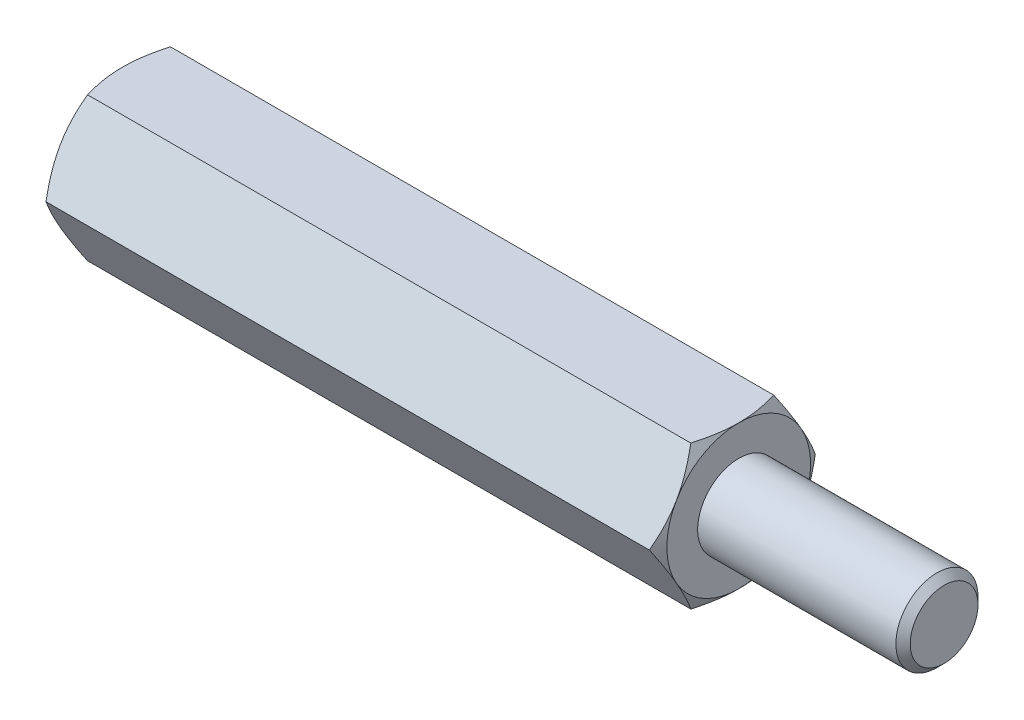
ISO-10303-21;
HEADER;
FILE_DESCRIPTION(('STEP AP214'),'2;1');
FILE_NAME('part.step','',(''),(''),'','','');
FILE_SCHEMA(('AUTOMOTIVE_DESIGN { 1 0 10303 214 1 1 1 1 }'));
ENDSEC;
DATA;
#1=APPLICATION_CONTEXT('core data for automotive mechanical design processes');
#2=APPLICATION_PROTOCOL_DEFINITION('international standard','automotive_design',2000,#1);
#3=PRODUCT_CONTEXT('',#1,'mechanical');
#4=PRODUCT('Part','Part','',(#3));
#5=PRODUCT_RELATED_PRODUCT_CATEGORY('part','',(#4));
#6=PRODUCT_DEFINITION_FORMATION('','',#4);
#7=PRODUCT_DEFINITION_CONTEXT('part definition',#1,'design');
#8=PRODUCT_DEFINITION('design','',#6,#7);
#9=PRODUCT_DEFINITION_SHAPE('','',#8);
#10=(LENGTH_UNIT() NAMED_UNIT(*) SI_UNIT(.MILLI.,.METRE.));
#11=(NAMED_UNIT(*) PLANE_ANGLE_UNIT() SI_UNIT($,.RADIAN.));
#12=(NAMED_UNIT(*) SI_UNIT($,.STERADIAN.) SOLID_ANGLE_UNIT());
#13=UNCERTAINTY_MEASURE_WITH_UNIT(LENGTH_MEASURE(1.E-05),#10,'distance_accuracy_value','');
#14=(GEOMETRIC_REPRESENTATION_CONTEXT(3) GLOBAL_UNCERTAINTY_ASSIGNED_CONTEXT((#13)) GLOBAL_UNIT_ASSIGNED_CONTEXT((#10,
#11,#12)) REPRESENTATION_CONTEXT('',''));
#15=CARTESIAN_POINT('',(0.,0.,0.));
#16=DIRECTION('',(0.,0.,1.));
#17=DIRECTION('',(1.,0.,0.));
#18=AXIS2_PLACEMENT_3D('',#15,#16,#17);
#19=CARTESIAN_POINT('',(15.,3.5,-2.02072594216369));
#20=DIRECTION('',(1.,0.,0.));
#21=DIRECTION('',(0.,0.,-1.));
#22=AXIS2_PLACEMENT_3D('',#19,#20,#21);
#23=PLANE('',#22);
#24=CARTESIAN_POINT('',(15.,0.,0.));
#25=DIRECTION('',(1.,0.,0.));
#26=DIRECTION('',(0.,0.,-1.));
#27=AXIS2_PLACEMENT_3D('',#24,#25,#26);
#28=CIRCLE('',#27,3.5);
#29=CARTESIAN_POINT('',(15.,-1.75,-3.03108891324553));
#30=VERTEX_POINT('',#29);
#31=CARTESIAN_POINT('',(15.,1.75,-3.03108891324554));
#32=VERTEX_POINT('',#31);
#33=EDGE_CURVE('E288',#30,#32,#28,.T.);
#34=ORIENTED_EDGE('',*,*,#33,.T.);
#35=CARTESIAN_POINT('',(15.,3.5,0.));
#36=VERTEX_POINT('',#35);
#37=EDGE_CURVE('E53',#32,#36,#28,.T.);
#38=ORIENTED_EDGE('',*,*,#37,.T.);
#39=CARTESIAN_POINT('',(15.,1.75,3.03108891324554));
#40=VERTEX_POINT('',#39);
#41=EDGE_CURVE('E297',#36,#40,#28,.T.);
#42=ORIENTED_EDGE('',*,*,#41,.T.);
#43=CARTESIAN_POINT('',(15.,-1.75000000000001,3.03108891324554));
#44=VERTEX_POINT('',#43);
#45=EDGE_CURVE('E301',#40,#44,#28,.T.);
#46=ORIENTED_EDGE('',*,*,#45,.T.);
#47=CARTESIAN_POINT('',(15.,0.,0.));
#48=DIRECTION('',(-1.,0.,0.));
#49=DIRECTION('',(0.,-1.,0.));
#50=AXIS2_PLACEMENT_3D('',#47,#48,#49);
#51=CIRCLE('',#50,3.5);
#52=CARTESIAN_POINT('',(15.,-3.50000000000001,0.));
#53=VERTEX_POINT('',#52);
#54=EDGE_CURVE('E193',#53,#44,#51,.T.);
#55=ORIENTED_EDGE('',*,*,#54,.F.);
#56=EDGE_CURVE('E61',#53,#30,#28,.T.);
#57=ORIENTED_EDGE('',*,*,#56,.T.);
#58=EDGE_LOOP('',(#34,#38,#42,#46,#55,#57));
#59=FACE_BOUND('',#58,.T.);
#60=CARTESIAN_POINT('',(15.,0.,0.));
#61=DIRECTION('',(1.,0.,0.));
#62=DIRECTION('',(0.,0.,-1.));
#63=AXIS2_PLACEMENT_3D('',#60,#61,#62);
#64=CIRCLE('',#63,2.);
#65=CARTESIAN_POINT('',(15.,0.,-2.));
#66=VERTEX_POINT('',#65);
#67=EDGE_CURVE('E324',#66,#66,#64,.T.);
#68=ORIENTED_EDGE('',*,*,#67,.F.);
#69=EDGE_LOOP('',(#68));
#70=FACE_BOUND('',#69,.T.);
#71=ADVANCED_FACE('F37',(#59,#70),#23,.T.);
#72=CARTESIAN_POINT('',(15.,0.,-4.04145188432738));
#73=DIRECTION('',(0.,-0.5,0.866025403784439));
#74=DIRECTION('',(0.,-0.866025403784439,-0.5));
#75=AXIS2_PLACEMENT_3D('',#72,#73,#74);
#76=PLANE('',#75);
#77=CARTESIAN_POINT('',(14.6873259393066,-0.000200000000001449,-4.04156735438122));
#78=CARTESIAN_POINT('',(14.73861421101,0.153607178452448,-3.9527667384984));
#79=CARTESIAN_POINT('',(14.7852590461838,0.308742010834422,-3.86319960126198));
#80=CARTESIAN_POINT('',(14.8666781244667,0.621698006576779,-3.68251437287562));
#81=CARTESIAN_POINT('',(14.9014235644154,0.779524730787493,-3.59139307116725));
#82=CARTESIAN_POINT('',(14.9555099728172,1.09322221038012,-3.41027974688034));
#83=CARTESIAN_POINT('',(14.9752109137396,1.24904469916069,-3.32031559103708));
#84=CARTESIAN_POINT('',(14.9987298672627,1.56142288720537,-3.13996396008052));
#85=CARTESIAN_POINT('',(15.0025673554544,1.71797745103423,-3.04957714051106));
#86=CARTESIAN_POINT('',(14.994584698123,2.01050921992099,-2.88068384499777));
#87=CARTESIAN_POINT('',(14.9847245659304,2.1465302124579,-2.80215208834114));
#88=CARTESIAN_POINT('',(14.9534735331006,2.41768602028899,-2.64560020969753));
#89=CARTESIAN_POINT('',(14.9320719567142,2.55281989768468,-2.5675806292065));
#90=CARTESIAN_POINT('',(14.8785695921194,2.82453479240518,-2.41070596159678));
#91=CARTESIAN_POINT('',(14.8462420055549,2.96108141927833,-2.33187072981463));
#92=CARTESIAN_POINT('',(14.772871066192,3.2321380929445,-2.17537608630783));
#93=CARTESIAN_POINT('',(14.7318449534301,3.36665161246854,-2.09771466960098));
#94=CARTESIAN_POINT('',(14.6873259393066,3.5002,-2.02061047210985));
#95=B_SPLINE_CURVE_WITH_KNOTS('',3,(#77,#78,#79,#80,#81,#82,#83,#84,#85,#86,#87,#88,#89,#90,#91,
#92,#93,#94),.UNSPECIFIED.,.F.,.F.,(4,2,2,2,2,2,2,2,4),(0.,0.554793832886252,1.11092123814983,
1.65328467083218,2.19498204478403,2.6666513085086,3.13875761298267,3.6213361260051,
4.10296698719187),.UNSPECIFIED.);
#96=CARTESIAN_POINT('',(14.6873926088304,0.,-4.04145188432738));
#97=VERTEX_POINT('',#96);
#98=EDGE_CURVE('E333',#97,#32,#95,.T.);
#99=ORIENTED_EDGE('',*,*,#98,.F.);
#100=DIRECTION('',(-1.,0.,0.));
#101=VECTOR('',#100,1.);
#102=CARTESIAN_POINT('',(15.,0.,-4.04145188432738));
#103=LINE('',#102,#101);
#104=CARTESIAN_POINT('',(-14.6873926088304,0.,-4.04145188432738));
#105=VERTEX_POINT('',#104);
#106=EDGE_CURVE('E264',#97,#105,#103,.T.);
#107=ORIENTED_EDGE('',*,*,#106,.T.);
#108=CARTESIAN_POINT('',(-14.6873259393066,3.5002,-2.02061047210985));
#109=CARTESIAN_POINT('',(-14.73861421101,3.34639282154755,-2.10941108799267));
#110=CARTESIAN_POINT('',(-14.7852590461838,3.19125798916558,-2.19897822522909));
#111=CARTESIAN_POINT('',(-14.8666781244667,2.87830199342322,-2.37966345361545));
#112=CARTESIAN_POINT('',(-14.9014235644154,2.7204752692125,-2.47078475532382));
#113=CARTESIAN_POINT('',(-14.9555099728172,2.40677778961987,-2.65189807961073));
#114=CARTESIAN_POINT('',(-14.9752109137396,2.25095530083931,-2.74186223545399));
#115=CARTESIAN_POINT('',(-14.9987298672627,1.93857711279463,-2.92221386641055));
#116=CARTESIAN_POINT('',(-15.0025673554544,1.78202254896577,-3.01260068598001));
#117=CARTESIAN_POINT('',(-14.994584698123,1.48949078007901,-3.1814939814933));
#118=CARTESIAN_POINT('',(-14.9847245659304,1.35346978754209,-3.26002573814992));
#119=CARTESIAN_POINT('',(-14.9534735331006,1.08231397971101,-3.41657761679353));
#120=CARTESIAN_POINT('',(-14.9320719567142,0.947180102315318,-3.49459719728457));
#121=CARTESIAN_POINT('',(-14.8785695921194,0.675465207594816,-3.65147186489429));
#122=CARTESIAN_POINT('',(-14.8462420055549,0.538918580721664,-3.73030709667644));
#123=CARTESIAN_POINT('',(-14.772871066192,0.267861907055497,-3.88680174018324));
#124=CARTESIAN_POINT('',(-14.7318449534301,0.133348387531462,-3.96446315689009));
#125=CARTESIAN_POINT('',(-14.6873259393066,-0.000200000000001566,-4.04156735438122));
#126=B_SPLINE_CURVE_WITH_KNOTS('',3,(#108,#109,#110,#111,#112,#113,#114,#115,#116,#117,#118,
#119,#120,#121,#122,#123,#124,#125),.UNSPECIFIED.,.F.,.F.,(4,2,2,2,2,2,2,2,4),(0.,
0.554793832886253,1.11092123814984,1.65328467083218,2.19498204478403,2.6666513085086,
3.13875761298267,3.6213361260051,4.10296698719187),.UNSPECIFIED.);
#127=CARTESIAN_POINT('',(-15.,1.75,-3.03108891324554));
#128=VERTEX_POINT('',#127);
#129=EDGE_CURVE('E343',#128,#105,#126,.T.);
#130=ORIENTED_EDGE('',*,*,#129,.F.);
#131=CARTESIAN_POINT('',(-14.6873926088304,3.5,-2.02072594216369));
#132=VERTEX_POINT('',#131);
#133=EDGE_CURVE('E348',#132,#128,#126,.T.);
#134=ORIENTED_EDGE('',*,*,#133,.F.);
#135=DIRECTION('',(-1.,0.,0.));
#136=VECTOR('',#135,1.);
#137=CARTESIAN_POINT('',(15.,3.5,-2.02072594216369));
#138=LINE('',#137,#136);
#139=CARTESIAN_POINT('',(14.6873926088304,3.5,-2.02072594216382));
#140=VERTEX_POINT('',#139);
#141=EDGE_CURVE('E279',#140,#132,#138,.T.);
#142=ORIENTED_EDGE('',*,*,#141,.F.);
#143=EDGE_CURVE('E229',#32,#140,#95,.T.);
#144=ORIENTED_EDGE('',*,*,#143,.F.);
#145=EDGE_LOOP('',(#99,#107,#130,#134,#142,#144));
#146=FACE_BOUND('',#145,.T.);
#147=ADVANCED_FACE('F148',(#146),#76,.F.);
#148=CARTESIAN_POINT('',(15.,3.5,-2.02072594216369));
#149=DIRECTION('',(0.,-1.,0.));
#150=DIRECTION('',(0.,0.,-1.));
#151=AXIS2_PLACEMENT_3D('',#148,#149,#150);
#152=PLANE('',#151);
#153=CARTESIAN_POINT('',(13.2443294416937,3.5,-5.525713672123));
#154=CARTESIAN_POINT('',(13.3192813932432,3.5,-5.37200190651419));
#155=CARTESIAN_POINT('',(13.3935424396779,3.5,-5.21794762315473));
#156=CARTESIAN_POINT('',(13.5402960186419,3.5,-4.90897223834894));
#157=CARTESIAN_POINT('',(13.6127882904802,3.5,-4.75405101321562));
#158=CARTESIAN_POINT('',(13.7559617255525,3.5,-4.44240758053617));
#159=CARTESIAN_POINT('',(13.8266316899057,3.5,-4.28568021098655));
#160=CARTESIAN_POINT('',(13.9652074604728,3.5,-3.97101270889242));
#161=CARTESIAN_POINT('',(14.0331133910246,3.5,-3.81307263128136));
#162=CARTESIAN_POINT('',(14.1677143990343,3.5,-3.49026114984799));
#163=CARTESIAN_POINT('',(14.2342871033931,3.5,-3.32533845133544));
#164=CARTESIAN_POINT('',(14.3626267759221,3.5,-2.99359992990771));
#165=CARTESIAN_POINT('',(14.4243932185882,3.5,-2.82678390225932));
#166=CARTESIAN_POINT('',(14.5415700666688,3.5,-2.49127529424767));
#167=CARTESIAN_POINT('',(14.5969925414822,3.5,-2.32258697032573));
#168=CARTESIAN_POINT('',(14.6997679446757,3.5,-1.98279215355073));
#169=CARTESIAN_POINT('',(14.7471233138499,3.5,-1.81168640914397));
#170=CARTESIAN_POINT('',(14.8312987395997,3.5,-1.46793354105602));
#171=CARTESIAN_POINT('',(14.8681796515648,3.5,-1.2953015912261));
#172=CARTESIAN_POINT('',(14.9293955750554,3.5,-0.94779164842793));
#173=CARTESIAN_POINT('',(14.953731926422,3.5,-0.772913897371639));
#174=CARTESIAN_POINT('',(14.9876038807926,3.5,-0.424108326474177));
#175=CARTESIAN_POINT('',(14.997337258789,3.5,-0.25020019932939));
#176=CARTESIAN_POINT('',(15.0017053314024,3.5,0.0978233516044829));
#177=CARTESIAN_POINT('',(14.9963399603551,3.5,0.271938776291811));
#178=CARTESIAN_POINT('',(14.9750118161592,3.5,0.564711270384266));
#179=CARTESIAN_POINT('',(14.9628919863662,3.5,0.683667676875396));
#180=CARTESIAN_POINT('',(14.9323080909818,3.5,0.920767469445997));
#181=CARTESIAN_POINT('',(14.9138432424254,3.5,1.03891075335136));
#182=CARTESIAN_POINT('',(14.8498956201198,3.5,1.39193174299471));
#183=CARTESIAN_POINT('',(14.7958695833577,3.5,1.62528232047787));
#184=CARTESIAN_POINT('',(14.7014515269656,3.5,1.97433825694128));
#185=CARTESIAN_POINT('',(14.6672900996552,3.5,2.09183268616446));
#186=CARTESIAN_POINT('',(14.595234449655,3.5,2.32568238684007));
#187=CARTESIAN_POINT('',(14.5573401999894,3.5,2.44203765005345));
#188=CARTESIAN_POINT('',(14.4784421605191,3.5,2.67364238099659));
#189=CARTESIAN_POINT('',(14.4374392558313,3.5,2.78889215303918));
#190=CARTESIAN_POINT('',(14.352824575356,3.5,3.01842460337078));
#191=CARTESIAN_POINT('',(14.3092128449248,3.5,3.13270729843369));
#192=CARTESIAN_POINT('',(14.1958241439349,3.5,3.42150510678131));
#193=CARTESIAN_POINT('',(14.1245636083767,3.5,3.59543696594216));
#194=CARTESIAN_POINT('',(13.9781026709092,3.5,3.94163961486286));
#195=CARTESIAN_POINT('',(13.9029019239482,3.5,4.11391025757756));
#196=CARTESIAN_POINT('',(13.7494252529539,3.5,4.45713072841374));
#197=CARTESIAN_POINT('',(13.6711484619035,3.5,4.62808016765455));
#198=CARTESIAN_POINT('',(13.512188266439,3.5,4.9688584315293));
#199=CARTESIAN_POINT('',(13.4315047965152,3.5,5.13868722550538));
#200=CARTESIAN_POINT('',(13.1863871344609,3.5,5.64726192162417));
#201=CARTESIAN_POINT('',(13.0190975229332,3.5,5.98463020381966));
#202=CARTESIAN_POINT('',(12.6795854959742,3.5,6.65678495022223));
#203=CARTESIAN_POINT('',(12.5073639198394,3.5,6.99157184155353));
#204=CARTESIAN_POINT('',(12.1760800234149,3.5,7.62749570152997));
#205=CARTESIAN_POINT('',(12.0173299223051,3.5,7.92879562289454));
#206=CARTESIAN_POINT('',(11.6977473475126,3.5,8.53030635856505));
#207=CARTESIAN_POINT('',(11.5369147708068,3.5,8.83051711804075));
#208=CARTESIAN_POINT('',(11.2141792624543,3.5,9.42918006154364));
#209=CARTESIAN_POINT('',(11.0522810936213,3.5,9.72763481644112));
#210=CARTESIAN_POINT('',(10.7272737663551,3.5,10.3238577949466));
#211=CARTESIAN_POINT('',(10.5641646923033,3.5,10.6216260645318));
#212=CARTESIAN_POINT('',(10.4006104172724,3.5,10.9191478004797));
#213=B_SPLINE_CURVE_WITH_KNOTS('',3,(#153,#154,#155,#156,#157,#158,#159,#160,#161,#162,#163,
#164,#165,#166,#167,#168,#169,#170,#171,#172,#173,#174,#175,#176,#177,#178,#179,#180,#181,#182,
#183,#184,#185,#186,#187,#188,#189,#190,#191,#192,#193,#194,#195,#196,#197,#198,#199,#200,#201,
#202,#203,#204,#205,#206,#207,#208,#209,#210,#211,#212),.UNSPECIFIED.,.F.,.F.,(4,2,2,2,2,2,2,2,
2,2,2,2,2,2,2,2,2,2,2,2,2,2,2,2,2,2,2,2,2,4),(0.,0.513041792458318,1.02615874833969,
1.5419080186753,2.05763406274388,2.59113284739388,3.1246898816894,3.65721433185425,
4.18957737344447,4.71878103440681,5.24792816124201,5.76984197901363,6.29175806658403,
6.65030258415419,7.0088913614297,7.72642330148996,8.09346920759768,8.46051776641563,
8.8274622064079,9.19440026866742,9.75822236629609,10.3220939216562,10.8861255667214,
11.4501725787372,12.579801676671,13.7092396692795,14.730918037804,15.7526471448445,
16.771258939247,17.7898004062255),.UNSPECIFIED.);
#214=EDGE_CURVE('E227',#140,#36,#213,.T.);
#215=ORIENTED_EDGE('',*,*,#214,.F.);
#216=ORIENTED_EDGE('',*,*,#141,.T.);
#217=CARTESIAN_POINT('',(-13.2443294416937,3.5,-5.525713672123));
#218=CARTESIAN_POINT('',(-13.3192813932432,3.5,-5.37200190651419));
#219=CARTESIAN_POINT('',(-13.3935424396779,3.5,-5.21794762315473));
#220=CARTESIAN_POINT('',(-13.5402960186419,3.5,-4.90897223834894));
#221=CARTESIAN_POINT('',(-13.6127882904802,3.5,-4.75405101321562));
#222=CARTESIAN_POINT('',(-13.7559617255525,3.5,-4.44240758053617));
#223=CARTESIAN_POINT('',(-13.8266316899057,3.5,-4.28568021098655));
#224=CARTESIAN_POINT('',(-13.9652074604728,3.5,-3.97101270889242));
#225=CARTESIAN_POINT('',(-14.0331133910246,3.5,-3.81307263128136));
#226=CARTESIAN_POINT('',(-14.1677143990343,3.5,-3.49026114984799));
#227=CARTESIAN_POINT('',(-14.2342871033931,3.5,-3.32533845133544));
#228=CARTESIAN_POINT('',(-14.3626267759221,3.5,-2.99359992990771));
#229=CARTESIAN_POINT('',(-14.4243932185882,3.5,-2.82678390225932));
#230=CARTESIAN_POINT('',(-14.5415700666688,3.5,-2.49127529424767));
#231=CARTESIAN_POINT('',(-14.5969925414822,3.5,-2.32258697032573));
#232=CARTESIAN_POINT('',(-14.6997679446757,3.5,-1.98279215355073));
#233=CARTESIAN_POINT('',(-14.7471233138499,3.5,-1.81168640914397));
#234=CARTESIAN_POINT('',(-14.8312987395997,3.5,-1.46793354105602));
#235=CARTESIAN_POINT('',(-14.8681796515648,3.5,-1.2953015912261));
#236=CARTESIAN_POINT('',(-14.9293955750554,3.5,-0.94779164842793));
#237=CARTESIAN_POINT('',(-14.953731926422,3.5,-0.77291389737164));
#238=CARTESIAN_POINT('',(-14.9876038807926,3.5,-0.424108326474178));
#239=CARTESIAN_POINT('',(-14.997337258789,3.5,-0.25020019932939));
#240=CARTESIAN_POINT('',(-15.0017053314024,3.5,0.0978233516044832));
#241=CARTESIAN_POINT('',(-14.9963399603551,3.5,0.271938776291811));
#242=CARTESIAN_POINT('',(-14.9750118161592,3.5,0.564711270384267));
#243=CARTESIAN_POINT('',(-14.9628919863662,3.5,0.683667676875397));
#244=CARTESIAN_POINT('',(-14.9323080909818,3.5,0.920767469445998));
#245=CARTESIAN_POINT('',(-14.9138432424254,3.5,1.03891075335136));
#246=CARTESIAN_POINT('',(-14.8498956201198,3.5,1.39193174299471));
#247=CARTESIAN_POINT('',(-14.7958695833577,3.5,1.62528232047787));
#248=CARTESIAN_POINT('',(-14.7014515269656,3.5,1.97433825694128));
#249=CARTESIAN_POINT('',(-14.6672900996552,3.5,2.09183268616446));
#250=CARTESIAN_POINT('',(-14.595234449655,3.5,2.32568238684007));
#251=CARTESIAN_POINT('',(-14.5573401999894,3.5,2.44203765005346));
#252=CARTESIAN_POINT('',(-14.4784421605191,3.5,2.67364238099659));
#253=CARTESIAN_POINT('',(-14.4374392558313,3.5,2.78889215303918));
#254=CARTESIAN_POINT('',(-14.352824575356,3.5,3.01842460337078));
#255=CARTESIAN_POINT('',(-14.3092128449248,3.5,3.13270729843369));
#256=CARTESIAN_POINT('',(-14.1958241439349,3.5,3.42150510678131));
#257=CARTESIAN_POINT('',(-14.1245636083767,3.5,3.59543696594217));
#258=CARTESIAN_POINT('',(-13.9781026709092,3.5,3.94163961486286));
#259=CARTESIAN_POINT('',(-13.9029019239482,3.5,4.11391025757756));
#260=CARTESIAN_POINT('',(-13.7494252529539,3.5,4.45713072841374));
#261=CARTESIAN_POINT('',(-13.6711484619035,3.5,4.62808016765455));
#262=CARTESIAN_POINT('',(-13.512188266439,3.5,4.9688584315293));
#263=CARTESIAN_POINT('',(-13.4315047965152,3.5,5.13868722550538));
#264=CARTESIAN_POINT('',(-13.1863871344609,3.5,5.64726192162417));
#265=CARTESIAN_POINT('',(-13.0190975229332,3.5,5.98463020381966));
#266=CARTESIAN_POINT('',(-12.6795854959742,3.5,6.65678495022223));
#267=CARTESIAN_POINT('',(-12.5073639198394,3.5,6.99157184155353));
#268=CARTESIAN_POINT('',(-12.1760800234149,3.5,7.62749570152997));
#269=CARTESIAN_POINT('',(-12.0173299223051,3.5,7.92879562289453));
#270=CARTESIAN_POINT('',(-11.6977473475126,3.5,8.53030635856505));
#271=CARTESIAN_POINT('',(-11.5369147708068,3.5,8.83051711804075));
#272=CARTESIAN_POINT('',(-11.2141792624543,3.5,9.42918006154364));
#273=CARTESIAN_POINT('',(-11.0522810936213,3.5,9.72763481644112));
#274=CARTESIAN_POINT('',(-10.7272737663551,3.5,10.3238577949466));
#275=CARTESIAN_POINT('',(-10.5641646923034,3.5,10.6216260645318));
#276=CARTESIAN_POINT('',(-10.4006104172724,3.5,10.9191478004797));
#277=B_SPLINE_CURVE_WITH_KNOTS('',3,(#217,#218,#219,#220,#221,#222,#223,#224,#225,#226,#227,
#228,#229,#230,#231,#232,#233,#234,#235,#236,#237,#238,#239,#240,#241,#242,#243,#244,#245,#246,
#247,#248,#249,#250,#251,#252,#253,#254,#255,#256,#257,#258,#259,#260,#261,#262,#263,#264,#265,
#266,#267,#268,#269,#270,#271,#272,#273,#274,#275,#276),.UNSPECIFIED.,.F.,.F.,(4,2,2,2,2,2,2,2,
2,2,2,2,2,2,2,2,2,2,2,2,2,2,2,2,2,2,2,2,2,4),(0.,0.513041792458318,1.02615874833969,
1.5419080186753,2.05763406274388,2.59113284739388,3.1246898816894,3.65721433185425,
4.18957737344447,4.71878103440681,5.24792816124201,5.76984197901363,6.29175806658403,
6.65030258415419,7.0088913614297,7.72642330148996,8.09346920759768,8.46051776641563,
8.8274622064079,9.19440026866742,9.75822236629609,10.3220939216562,10.8861255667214,
11.4501725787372,12.579801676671,13.7092396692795,14.730918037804,15.7526471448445,
16.7712589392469,17.7898004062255),.UNSPECIFIED.);
#278=CARTESIAN_POINT('',(-15.,3.5,0.));
#279=VERTEX_POINT('',#278);
#280=EDGE_CURVE('E241',#279,#132,#277,.F.);
#281=ORIENTED_EDGE('',*,*,#280,.F.);
#282=CARTESIAN_POINT('',(-14.6873926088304,3.5,2.02072594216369));
#283=VERTEX_POINT('',#282);
#284=EDGE_CURVE('E249',#283,#279,#277,.F.);
#285=ORIENTED_EDGE('',*,*,#284,.F.);
#286=DIRECTION('',(-1.,0.,0.));
#287=VECTOR('',#286,1.);
#288=CARTESIAN_POINT('',(15.,3.5,2.02072594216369));
#289=LINE('',#288,#287);
#290=CARTESIAN_POINT('',(14.6873926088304,3.5,2.02072594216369));
#291=VERTEX_POINT('',#290);
#292=EDGE_CURVE('E276',#291,#283,#289,.T.);
#293=ORIENTED_EDGE('',*,*,#292,.F.);
#294=EDGE_CURVE('E221',#36,#291,#213,.T.);
#295=ORIENTED_EDGE('',*,*,#294,.F.);
#296=EDGE_LOOP('',(#215,#216,#281,#285,#293,#295));
#297=FACE_BOUND('',#296,.T.);
#298=ADVANCED_FACE('F153',(#297),#152,.F.);
#299=CARTESIAN_POINT('',(15.,3.5,2.02072594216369));
#300=DIRECTION('',(0.,-0.5,-0.866025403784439));
#301=DIRECTION('',(0.,0.866025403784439,-0.5));
#302=AXIS2_PLACEMENT_3D('',#299,#300,#301);
#303=PLANE('',#302);
#304=CARTESIAN_POINT('',(14.6873259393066,3.5002,2.02061047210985));
#305=CARTESIAN_POINT('',(14.73861421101,3.34639282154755,2.10941108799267));
#306=CARTESIAN_POINT('',(14.7852590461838,3.19125798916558,2.19897822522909));
#307=CARTESIAN_POINT('',(14.8666781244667,2.87830199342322,2.37966345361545));
#308=CARTESIAN_POINT('',(14.9014235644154,2.7204752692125,2.47078475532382));
#309=CARTESIAN_POINT('',(14.9555099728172,2.40677778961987,2.65189807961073));
#310=CARTESIAN_POINT('',(14.9752109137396,2.25095530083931,2.74186223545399));
#311=CARTESIAN_POINT('',(14.9987298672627,1.93857711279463,2.92221386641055));
#312=CARTESIAN_POINT('',(15.0025673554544,1.78202254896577,3.01260068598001));
#313=CARTESIAN_POINT('',(14.994584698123,1.48949078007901,3.1814939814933));
#314=CARTESIAN_POINT('',(14.9847245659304,1.35346978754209,3.26002573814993));
#315=CARTESIAN_POINT('',(14.9534735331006,1.08231397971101,3.41657761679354));
#316=CARTESIAN_POINT('',(14.9320719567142,0.947180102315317,3.49459719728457));
#317=CARTESIAN_POINT('',(14.8785695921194,0.675465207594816,3.65147186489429));
#318=CARTESIAN_POINT('',(14.8462420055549,0.538918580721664,3.73030709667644));
#319=CARTESIAN_POINT('',(14.772871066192,0.267861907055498,3.88680174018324));
#320=CARTESIAN_POINT('',(14.7318449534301,0.133348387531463,3.96446315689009));
#321=CARTESIAN_POINT('',(14.6873259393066,-0.000200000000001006,4.04156735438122));
#322=B_SPLINE_CURVE_WITH_KNOTS('',3,(#304,#305,#306,#307,#308,#309,#310,#311,#312,#313,#314,
#315,#316,#317,#318,#319,#320,#321),.UNSPECIFIED.,.F.,.F.,(4,2,2,2,2,2,2,2,4),(0.,
0.554793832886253,1.11092123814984,1.65328467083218,2.19498204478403,2.6666513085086,
3.13875761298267,3.62133612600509,4.10296698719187),.UNSPECIFIED.);
#323=EDGE_CURVE('E228',#291,#40,#322,.T.);
#324=ORIENTED_EDGE('',*,*,#323,.F.);
#325=ORIENTED_EDGE('',*,*,#292,.T.);
#326=CARTESIAN_POINT('',(-14.6873259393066,-0.000200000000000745,4.04156735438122));
#327=CARTESIAN_POINT('',(-14.73861421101,0.153607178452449,3.9527667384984));
#328=CARTESIAN_POINT('',(-14.7852590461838,0.308742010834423,3.86319960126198));
#329=CARTESIAN_POINT('',(-14.8666781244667,0.62169800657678,3.68251437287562));
#330=CARTESIAN_POINT('',(-14.9014235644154,0.779524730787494,3.59139307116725));
#331=CARTESIAN_POINT('',(-14.9555099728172,1.09322221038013,3.41027974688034));
#332=CARTESIAN_POINT('',(-14.9752109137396,1.24904469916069,3.32031559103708));
#333=CARTESIAN_POINT('',(-14.9987298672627,1.56142288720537,3.13996396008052));
#334=CARTESIAN_POINT('',(-15.0025673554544,1.71797745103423,3.04957714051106));
#335=CARTESIAN_POINT('',(-14.994584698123,2.01050921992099,2.88068384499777));
#336=CARTESIAN_POINT('',(-14.9847245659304,2.1465302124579,2.80215208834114));
#337=CARTESIAN_POINT('',(-14.9534735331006,2.41768602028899,2.64560020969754));
#338=CARTESIAN_POINT('',(-14.9320719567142,2.55281989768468,2.5675806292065));
#339=CARTESIAN_POINT('',(-14.8785695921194,2.82453479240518,2.41070596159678));
#340=CARTESIAN_POINT('',(-14.8462420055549,2.96108141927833,2.33187072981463));
#341=CARTESIAN_POINT('',(-14.772871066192,3.2321380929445,2.17537608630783));
#342=CARTESIAN_POINT('',(-14.7318449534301,3.36665161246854,2.09771466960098));
#343=CARTESIAN_POINT('',(-14.6873259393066,3.5002,2.02061047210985));
#344=B_SPLINE_CURVE_WITH_KNOTS('',3,(#326,#327,#328,#329,#330,#331,#332,#333,#334,#335,#336,
#337,#338,#339,#340,#341,#342,#343),.UNSPECIFIED.,.F.,.F.,(4,2,2,2,2,2,2,2,4),(0.,
0.554793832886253,1.11092123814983,1.65328467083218,2.19498204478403,2.6666513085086,
3.13875761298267,3.62133612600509,4.10296698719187),.UNSPECIFIED.);
#345=CARTESIAN_POINT('',(-15.,1.75,3.03108891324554));
#346=VERTEX_POINT('',#345);
#347=EDGE_CURVE('E255',#346,#283,#344,.T.);
#348=ORIENTED_EDGE('',*,*,#347,.F.);
#349=CARTESIAN_POINT('',(-14.6873926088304,0.,4.04145188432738));
#350=VERTEX_POINT('',#349);
#351=EDGE_CURVE('E262',#350,#346,#344,.T.);
#352=ORIENTED_EDGE('',*,*,#351,.F.);
#353=DIRECTION('',(-1.,0.,0.));
#354=VECTOR('',#353,1.);
#355=CARTESIAN_POINT('',(15.,0.,4.04145188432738));
#356=LINE('',#355,#354);
#357=CARTESIAN_POINT('',(14.6873926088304,0.,4.04145188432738));
#358=VERTEX_POINT('',#357);
#359=EDGE_CURVE('E273',#358,#350,#356,.T.);
#360=ORIENTED_EDGE('',*,*,#359,.F.);
#361=EDGE_CURVE('E215',#40,#358,#322,.T.);
#362=ORIENTED_EDGE('',*,*,#361,.F.);
#363=EDGE_LOOP('',(#324,#325,#348,#352,#360,#362));
#364=FACE_BOUND('',#363,.T.);
#365=ADVANCED_FACE('F235',(#364),#303,.F.);
#366=CARTESIAN_POINT('',(15.,0.,4.04145188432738));
#367=DIRECTION('',(0.,0.5,-0.866025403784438));
#368=DIRECTION('',(0.,0.866025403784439,0.5));
#369=AXIS2_PLACEMENT_3D('',#366,#367,#368);
#370=PLANE('',#369);
#371=CARTESIAN_POINT('',(14.6873259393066,0.000199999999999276,4.04156735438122));
#372=CARTESIAN_POINT('',(14.73861421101,-0.15360717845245,3.9527667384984));
#373=CARTESIAN_POINT('',(14.7852590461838,-0.308742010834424,3.86319960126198));
#374=CARTESIAN_POINT('',(14.8666781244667,-0.621698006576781,3.68251437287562));
#375=CARTESIAN_POINT('',(14.9014235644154,-0.779524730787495,3.59139307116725));
#376=CARTESIAN_POINT('',(14.9555099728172,-1.09322221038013,3.41027974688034));
#377=CARTESIAN_POINT('',(14.9752109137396,-1.24904469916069,3.32031559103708));
#378=CARTESIAN_POINT('',(14.9987298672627,-1.56142288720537,3.13996396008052));
#379=CARTESIAN_POINT('',(15.0025673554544,-1.71797745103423,3.04957714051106));
#380=CARTESIAN_POINT('',(14.994584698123,-2.01050921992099,2.88068384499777));
#381=CARTESIAN_POINT('',(14.9847245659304,-2.1465302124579,2.80215208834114));
#382=CARTESIAN_POINT('',(14.9534735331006,-2.41768602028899,2.64560020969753));
#383=CARTESIAN_POINT('',(14.9320719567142,-2.55281989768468,2.5675806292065));
#384=CARTESIAN_POINT('',(14.8785695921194,-2.82453479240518,2.41070596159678));
#385=CARTESIAN_POINT('',(14.8462420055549,-2.96108141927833,2.33187072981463));
#386=CARTESIAN_POINT('',(14.772871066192,-3.2321380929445,2.17537608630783));
#387=CARTESIAN_POINT('',(14.7318449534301,-3.36665161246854,2.09771466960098));
#388=CARTESIAN_POINT('',(14.6873259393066,-3.5002,2.02061047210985));
#389=B_SPLINE_CURVE_WITH_KNOTS('',3,(#371,#372,#373,#374,#375,#376,#377,#378,#379,#380,#381,
#382,#383,#384,#385,#386,#387,#388),.UNSPECIFIED.,.F.,.F.,(4,2,2,2,2,2,2,2,4),(0.,
0.554793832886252,1.11092123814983,1.65328467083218,2.19498204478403,2.6666513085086,
3.13875761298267,3.62133612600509,4.10296698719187),.UNSPECIFIED.);
#390=EDGE_CURVE('E334',#358,#44,#389,.T.);
#391=ORIENTED_EDGE('',*,*,#390,.F.);
#392=ORIENTED_EDGE('',*,*,#359,.T.);
#393=CARTESIAN_POINT('',(-14.6873259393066,-3.5002,2.02061047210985));
#394=CARTESIAN_POINT('',(-14.73861421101,-3.34639282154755,2.10941108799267));
#395=CARTESIAN_POINT('',(-14.7852590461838,-3.19125798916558,2.19897822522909));
#396=CARTESIAN_POINT('',(-14.8666781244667,-2.87830199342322,2.37966345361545));
#397=CARTESIAN_POINT('',(-14.9014235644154,-2.72047526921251,2.47078475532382));
#398=CARTESIAN_POINT('',(-14.9555099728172,-2.40677778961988,2.65189807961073));
#399=CARTESIAN_POINT('',(-14.9752109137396,-2.25095530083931,2.74186223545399));
#400=CARTESIAN_POINT('',(-14.9987298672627,-1.93857711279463,2.92221386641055));
#401=CARTESIAN_POINT('',(-15.0025673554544,-1.78202254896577,3.01260068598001));
#402=CARTESIAN_POINT('',(-14.994584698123,-1.48949078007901,3.1814939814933));
#403=CARTESIAN_POINT('',(-14.9847245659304,-1.3534697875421,3.26002573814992));
#404=CARTESIAN_POINT('',(-14.9534735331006,-1.08231397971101,3.41657761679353));
#405=CARTESIAN_POINT('',(-14.9320719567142,-0.94718010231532,3.49459719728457));
#406=CARTESIAN_POINT('',(-14.8785695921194,-0.675465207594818,3.65147186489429));
#407=CARTESIAN_POINT('',(-14.8462420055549,-0.538918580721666,3.73030709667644));
#408=CARTESIAN_POINT('',(-14.772871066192,-0.2678619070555,3.88680174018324));
#409=CARTESIAN_POINT('',(-14.7318449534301,-0.133348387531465,3.96446315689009));
#410=CARTESIAN_POINT('',(-14.6873259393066,0.000199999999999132,4.04156735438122));
#411=B_SPLINE_CURVE_WITH_KNOTS('',3,(#393,#394,#395,#396,#397,#398,#399,#400,#401,#402,#403,
#404,#405,#406,#407,#408,#409,#410),.UNSPECIFIED.,.F.,.F.,(4,2,2,2,2,2,2,2,4),(0.,
0.554793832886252,1.11092123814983,1.65328467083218,2.19498204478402,2.66665130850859,
3.13875761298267,3.62133612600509,4.10296698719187),.UNSPECIFIED.);
#412=CARTESIAN_POINT('',(-15.,-1.75000000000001,3.03108891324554));
#413=VERTEX_POINT('',#412);
#414=EDGE_CURVE('E263',#413,#350,#411,.T.);
#415=ORIENTED_EDGE('',*,*,#414,.F.);
#416=CARTESIAN_POINT('',(-14.6873926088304,-3.5,2.02072594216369));
#417=VERTEX_POINT('',#416);
#418=EDGE_CURVE('E250',#417,#413,#411,.T.);
#419=ORIENTED_EDGE('',*,*,#418,.F.);
#420=DIRECTION('',(-1.,0.,0.));
#421=VECTOR('',#420,1.);
#422=CARTESIAN_POINT('',(15.,-3.5,2.02072594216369));
#423=LINE('',#422,#421);
#424=CARTESIAN_POINT('',(14.6873926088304,-3.5,2.02072594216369));
#425=VERTEX_POINT('',#424);
#426=EDGE_CURVE('E270',#425,#417,#423,.T.);
#427=ORIENTED_EDGE('',*,*,#426,.F.);
#428=EDGE_CURVE('E210',#44,#425,#389,.T.);
#429=ORIENTED_EDGE('',*,*,#428,.F.);
#430=EDGE_LOOP('',(#391,#392,#415,#419,#427,#429));
#431=FACE_BOUND('',#430,.T.);
#432=ADVANCED_FACE('F384',(#431),#370,.F.);
#433=CARTESIAN_POINT('',(15.,-3.5,2.02072594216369));
#434=DIRECTION('',(0.,1.,0.));
#435=DIRECTION('',(0.,0.,1.));
#436=AXIS2_PLACEMENT_3D('',#433,#434,#435);
#437=PLANE('',#436);
#438=CARTESIAN_POINT('',(13.2443294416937,-3.5,-5.525713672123));
#439=CARTESIAN_POINT('',(13.3192813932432,-3.5,-5.37200190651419));
#440=CARTESIAN_POINT('',(13.3935424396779,-3.5,-5.21794762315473));
#441=CARTESIAN_POINT('',(13.5402960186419,-3.5,-4.90897223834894));
#442=CARTESIAN_POINT('',(13.6127882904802,-3.5,-4.75405101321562));
#443=CARTESIAN_POINT('',(13.7559617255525,-3.5,-4.44240758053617));
#444=CARTESIAN_POINT('',(13.8266316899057,-3.5,-4.28568021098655));
#445=CARTESIAN_POINT('',(13.9652074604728,-3.5,-3.97101270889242));
#446=CARTESIAN_POINT('',(14.0331133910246,-3.5,-3.81307263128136));
#447=CARTESIAN_POINT('',(14.1677143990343,-3.5,-3.49026114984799));
#448=CARTESIAN_POINT('',(14.2342871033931,-3.5,-3.32533845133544));
#449=CARTESIAN_POINT('',(14.3626267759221,-3.5,-2.99359992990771));
#450=CARTESIAN_POINT('',(14.4243932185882,-3.5,-2.82678390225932));
#451=CARTESIAN_POINT('',(14.5415700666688,-3.5,-2.49127529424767));
#452=CARTESIAN_POINT('',(14.5969925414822,-3.5,-2.32258697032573));
#453=CARTESIAN_POINT('',(14.6997679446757,-3.5,-1.98279215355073));
#454=CARTESIAN_POINT('',(14.7471233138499,-3.5,-1.81168640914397));
#455=CARTESIAN_POINT('',(14.8312987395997,-3.5,-1.46793354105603));
#456=CARTESIAN_POINT('',(14.8681796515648,-3.5,-1.2953015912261));
#457=CARTESIAN_POINT('',(14.9293955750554,-3.5,-0.947791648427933));
#458=CARTESIAN_POINT('',(14.953731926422,-3.5,-0.772913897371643));
#459=CARTESIAN_POINT('',(14.9876038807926,-3.5,-0.42410832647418));
#460=CARTESIAN_POINT('',(14.997337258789,-3.5,-0.250200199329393));
#461=CARTESIAN_POINT('',(15.0017053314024,-3.5,0.0978233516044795));
#462=CARTESIAN_POINT('',(14.9963399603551,-3.5,0.271938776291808));
#463=CARTESIAN_POINT('',(14.9750118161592,-3.5,0.564711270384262));
#464=CARTESIAN_POINT('',(14.9628919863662,-3.5,0.683667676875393));
#465=CARTESIAN_POINT('',(14.9323080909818,-3.5,0.920767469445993));
#466=CARTESIAN_POINT('',(14.9138432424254,-3.5,1.03891075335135));
#467=CARTESIAN_POINT('',(14.8498956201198,-3.5,1.3919317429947));
#468=CARTESIAN_POINT('',(14.7958695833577,-3.5,1.62528232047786));
#469=CARTESIAN_POINT('',(14.7014515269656,-3.5,1.97433825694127));
#470=CARTESIAN_POINT('',(14.6672900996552,-3.5,2.09183268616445));
#471=CARTESIAN_POINT('',(14.595234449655,-3.5,2.32568238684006));
#472=CARTESIAN_POINT('',(14.5573401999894,-3.5,2.44203765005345));
#473=CARTESIAN_POINT('',(14.4784421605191,-3.5,2.67364238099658));
#474=CARTESIAN_POINT('',(14.4374392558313,-3.5,2.78889215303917));
#475=CARTESIAN_POINT('',(14.352824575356,-3.5,3.01842460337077));
#476=CARTESIAN_POINT('',(14.3092128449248,-3.5,3.13270729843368));
#477=CARTESIAN_POINT('',(14.1958241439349,-3.5,3.4215051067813));
#478=CARTESIAN_POINT('',(14.1245636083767,-3.5,3.59543696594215));
#479=CARTESIAN_POINT('',(13.9781026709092,-3.5,3.94163961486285));
#480=CARTESIAN_POINT('',(13.9029019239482,-3.5,4.11391025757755));
#481=CARTESIAN_POINT('',(13.7494252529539,-3.5,4.45713072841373));
#482=CARTESIAN_POINT('',(13.6711484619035,-3.5,4.62808016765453));
#483=CARTESIAN_POINT('',(13.5121882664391,-3.5,4.96885843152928));
#484=CARTESIAN_POINT('',(13.4315047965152,-3.5,5.13868722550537));
#485=CARTESIAN_POINT('',(13.1863871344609,-3.5,5.64726192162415));
#486=CARTESIAN_POINT('',(13.0190975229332,-3.5,5.98463020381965));
#487=CARTESIAN_POINT('',(12.6795854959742,-3.5,6.65678495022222));
#488=CARTESIAN_POINT('',(12.5073639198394,-3.5,6.99157184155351));
#489=CARTESIAN_POINT('',(12.1760800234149,-3.5,7.62749570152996));
#490=CARTESIAN_POINT('',(12.0173299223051,-3.5,7.92879562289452));
#491=CARTESIAN_POINT('',(11.6977473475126,-3.5,8.53030635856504));
#492=CARTESIAN_POINT('',(11.5369147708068,-3.5,8.83051711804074));
#493=CARTESIAN_POINT('',(11.2141792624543,-3.5,9.42918006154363));
#494=CARTESIAN_POINT('',(11.0522810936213,-3.5,9.72763481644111));
#495=CARTESIAN_POINT('',(10.7272737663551,-3.5,10.3238577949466));
#496=CARTESIAN_POINT('',(10.5641646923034,-3.5,10.6216260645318));
#497=CARTESIAN_POINT('',(10.4006104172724,-3.5,10.9191478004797));
#498=B_SPLINE_CURVE_WITH_KNOTS('',3,(#438,#439,#440,#441,#442,#443,#444,#445,#446,#447,#448,
#449,#450,#451,#452,#453,#454,#455,#456,#457,#458,#459,#460,#461,#462,#463,#464,#465,#466,#467,
#468,#469,#470,#471,#472,#473,#474,#475,#476,#477,#478,#479,#480,#481,#482,#483,#484,#485,#486,
#487,#488,#489,#490,#491,#492,#493,#494,#495,#496,#497),.UNSPECIFIED.,.F.,.F.,(4,2,2,2,2,2,2,2,
2,2,2,2,2,2,2,2,2,2,2,2,2,2,2,2,2,2,2,2,2,4),(0.,0.513041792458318,1.02615874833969,
1.54190801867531,2.05763406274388,2.59113284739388,3.1246898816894,3.65721433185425,
4.18957737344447,4.71878103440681,5.24792816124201,5.76984197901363,6.29175806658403,
6.65030258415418,7.0088913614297,7.72642330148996,8.09346920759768,8.46051776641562,
8.8274622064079,9.1944002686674,9.75822236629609,10.3220939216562,10.8861255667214,
11.4501725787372,12.579801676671,13.7092396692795,14.730918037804,15.7526471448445,
16.7712589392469,17.7898004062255),.UNSPECIFIED.);
#499=EDGE_CURVE('E335',#425,#53,#498,.F.);
#500=ORIENTED_EDGE('',*,*,#499,.F.);
#501=ORIENTED_EDGE('',*,*,#426,.T.);
#502=CARTESIAN_POINT('',(-13.2443294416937,-3.5,-5.52571367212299));
#503=CARTESIAN_POINT('',(-13.3192813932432,-3.5,-5.37200190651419));
#504=CARTESIAN_POINT('',(-13.3935424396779,-3.5,-5.21794762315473));
#505=CARTESIAN_POINT('',(-13.5402960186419,-3.5,-4.90897223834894));
#506=CARTESIAN_POINT('',(-13.6127882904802,-3.5,-4.75405101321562));
#507=CARTESIAN_POINT('',(-13.7559617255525,-3.5,-4.44240758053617));
#508=CARTESIAN_POINT('',(-13.8266316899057,-3.5,-4.28568021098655));
#509=CARTESIAN_POINT('',(-13.9652074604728,-3.5,-3.97101270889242));
#510=CARTESIAN_POINT('',(-14.0331133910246,-3.5,-3.81307263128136));
#511=CARTESIAN_POINT('',(-14.1677143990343,-3.5,-3.49026114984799));
#512=CARTESIAN_POINT('',(-14.2342871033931,-3.5,-3.32533845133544));
#513=CARTESIAN_POINT('',(-14.3626267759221,-3.5,-2.99359992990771));
#514=CARTESIAN_POINT('',(-14.4243932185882,-3.5,-2.82678390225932));
#515=CARTESIAN_POINT('',(-14.5415700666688,-3.5,-2.49127529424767));
#516=CARTESIAN_POINT('',(-14.5969925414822,-3.5,-2.32258697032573));
#517=CARTESIAN_POINT('',(-14.6997679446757,-3.5,-1.98279215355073));
#518=CARTESIAN_POINT('',(-14.7471233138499,-3.5,-1.81168640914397));
#519=CARTESIAN_POINT('',(-14.8312987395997,-3.5,-1.46793354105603));
#520=CARTESIAN_POINT('',(-14.8681796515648,-3.5,-1.2953015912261));
#521=CARTESIAN_POINT('',(-14.9293955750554,-3.5,-0.947791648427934));
#522=CARTESIAN_POINT('',(-14.953731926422,-3.5,-0.772913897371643));
#523=CARTESIAN_POINT('',(-14.9876038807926,-3.5,-0.424108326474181));
#524=CARTESIAN_POINT('',(-14.997337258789,-3.5,-0.250200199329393));
#525=CARTESIAN_POINT('',(-15.0017053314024,-3.5,0.0978233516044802));
#526=CARTESIAN_POINT('',(-14.9963399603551,-3.5,0.271938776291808));
#527=CARTESIAN_POINT('',(-14.9750118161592,-3.5,0.564711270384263));
#528=CARTESIAN_POINT('',(-14.9628919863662,-3.5,0.683667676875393));
#529=CARTESIAN_POINT('',(-14.9323080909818,-3.5,0.920767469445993));
#530=CARTESIAN_POINT('',(-14.9138432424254,-3.5,1.03891075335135));
#531=CARTESIAN_POINT('',(-14.8498956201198,-3.5,1.39193174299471));
#532=CARTESIAN_POINT('',(-14.7958695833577,-3.5,1.62528232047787));
#533=CARTESIAN_POINT('',(-14.7014515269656,-3.5,1.97433825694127));
#534=CARTESIAN_POINT('',(-14.6672900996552,-3.5,2.09183268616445));
#535=CARTESIAN_POINT('',(-14.595234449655,-3.5,2.32568238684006));
#536=CARTESIAN_POINT('',(-14.5573401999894,-3.5,2.44203765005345));
#537=CARTESIAN_POINT('',(-14.4784421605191,-3.5,2.67364238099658));
#538=CARTESIAN_POINT('',(-14.4374392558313,-3.5,2.78889215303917));
#539=CARTESIAN_POINT('',(-14.352824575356,-3.5,3.01842460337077));
#540=CARTESIAN_POINT('',(-14.3092128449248,-3.5,3.13270729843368));
#541=CARTESIAN_POINT('',(-14.1958241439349,-3.5,3.4215051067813));
#542=CARTESIAN_POINT('',(-14.1245636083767,-3.5,3.59543696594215));
#543=CARTESIAN_POINT('',(-13.9781026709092,-3.5,3.94163961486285));
#544=CARTESIAN_POINT('',(-13.9029019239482,-3.5,4.11391025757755));
#545=CARTESIAN_POINT('',(-13.7494252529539,-3.5,4.45713072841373));
#546=CARTESIAN_POINT('',(-13.6711484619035,-3.5,4.62808016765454));
#547=CARTESIAN_POINT('',(-13.512188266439,-3.5,4.96885843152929));
#548=CARTESIAN_POINT('',(-13.4315047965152,-3.5,5.13868722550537));
#549=CARTESIAN_POINT('',(-13.1863871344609,-3.5,5.64726192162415));
#550=CARTESIAN_POINT('',(-13.0190975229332,-3.5,5.98463020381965));
#551=CARTESIAN_POINT('',(-12.6795854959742,-3.5,6.65678495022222));
#552=CARTESIAN_POINT('',(-12.5073639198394,-3.5,6.99157184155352));
#553=CARTESIAN_POINT('',(-12.1760800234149,-3.5,7.62749570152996));
#554=CARTESIAN_POINT('',(-12.0173299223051,-3.5,7.92879562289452));
#555=CARTESIAN_POINT('',(-11.6977473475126,-3.5,8.53030635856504));
#556=CARTESIAN_POINT('',(-11.5369147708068,-3.5,8.83051711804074));
#557=CARTESIAN_POINT('',(-11.2141792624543,-3.5,9.42918006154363));
#558=CARTESIAN_POINT('',(-11.0522810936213,-3.5,9.72763481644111));
#559=CARTESIAN_POINT('',(-10.7272737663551,-3.5,10.3238577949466));
#560=CARTESIAN_POINT('',(-10.5641646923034,-3.5,10.6216260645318));
#561=CARTESIAN_POINT('',(-10.4006104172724,-3.5,10.9191478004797));
#562=B_SPLINE_CURVE_WITH_KNOTS('',3,(#502,#503,#504,#505,#506,#507,#508,#509,#510,#511,#512,
#513,#514,#515,#516,#517,#518,#519,#520,#521,#522,#523,#524,#525,#526,#527,#528,#529,#530,#531,
#532,#533,#534,#535,#536,#537,#538,#539,#540,#541,#542,#543,#544,#545,#546,#547,#548,#549,#550,
#551,#552,#553,#554,#555,#556,#557,#558,#559,#560,#561),.UNSPECIFIED.,.F.,.F.,(4,2,2,2,2,2,2,2,
2,2,2,2,2,2,2,2,2,2,2,2,2,2,2,2,2,2,2,2,2,4),(0.,0.513041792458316,1.02615874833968,
1.5419080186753,2.05763406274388,2.59113284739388,3.1246898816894,3.65721433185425,
4.18957737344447,4.71878103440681,5.247928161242,5.76984197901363,6.29175806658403,
6.65030258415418,7.0088913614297,7.72642330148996,8.09346920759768,8.46051776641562,
8.82746220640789,9.1944002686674,9.75822236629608,10.3220939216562,10.8861255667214,
11.4501725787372,12.579801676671,13.7092396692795,14.730918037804,15.7526471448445,
16.7712589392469,17.7898004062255),.UNSPECIFIED.);
#563=CARTESIAN_POINT('',(-15.,-3.50000000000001,0.));
#564=VERTEX_POINT('',#563);
#565=EDGE_CURVE('E345',#564,#417,#562,.T.);
#566=ORIENTED_EDGE('',*,*,#565,.F.);
#567=CARTESIAN_POINT('',(-14.6873926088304,-3.5,-2.02072594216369));
#568=VERTEX_POINT('',#567);
#569=EDGE_CURVE('E341',#568,#564,#562,.T.);
#570=ORIENTED_EDGE('',*,*,#569,.F.);
#571=DIRECTION('',(-1.,0.,0.));
#572=VECTOR('',#571,1.);
#573=CARTESIAN_POINT('',(15.,-3.5,-2.02072594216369));
#574=LINE('',#573,#572);
#575=CARTESIAN_POINT('',(14.6873926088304,-3.5,-2.02072594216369));
#576=VERTEX_POINT('',#575);
#577=EDGE_CURVE('E267',#576,#568,#574,.T.);
#578=ORIENTED_EDGE('',*,*,#577,.F.);
#579=EDGE_CURVE('E195',#53,#576,#498,.F.);
#580=ORIENTED_EDGE('',*,*,#579,.F.);
#581=EDGE_LOOP('',(#500,#501,#566,#570,#578,#580));
#582=FACE_BOUND('',#581,.T.);
#583=ADVANCED_FACE('F172',(#582),#437,.F.);
#584=CARTESIAN_POINT('',(15.,-3.5,-2.02072594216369));
#585=DIRECTION('',(0.,0.5,0.866025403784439));
#586=DIRECTION('',(0.,-0.866025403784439,0.5));
#587=AXIS2_PLACEMENT_3D('',#584,#585,#586);
#588=PLANE('',#587);
#589=CARTESIAN_POINT('',(14.6873259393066,-3.5002,-2.02061047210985));
#590=CARTESIAN_POINT('',(14.73861421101,-3.34639282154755,-2.10941108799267));
#591=CARTESIAN_POINT('',(14.7852590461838,-3.19125798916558,-2.19897822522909));
#592=CARTESIAN_POINT('',(14.8666781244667,-2.87830199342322,-2.37966345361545));
#593=CARTESIAN_POINT('',(14.9014235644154,-2.72047526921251,-2.47078475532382));
#594=CARTESIAN_POINT('',(14.9555099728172,-2.40677778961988,-2.65189807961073));
#595=CARTESIAN_POINT('',(14.9752109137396,-2.25095530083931,-2.74186223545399));
#596=CARTESIAN_POINT('',(14.9987298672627,-1.93857711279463,-2.92221386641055));
#597=CARTESIAN_POINT('',(15.0025673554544,-1.78202254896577,-3.01260068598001));
#598=CARTESIAN_POINT('',(14.994584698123,-1.48949078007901,-3.1814939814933));
#599=CARTESIAN_POINT('',(14.9847245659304,-1.3534697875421,-3.26002573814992));
#600=CARTESIAN_POINT('',(14.9534735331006,-1.08231397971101,-3.41657761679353));
#601=CARTESIAN_POINT('',(14.9320719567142,-0.94718010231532,-3.49459719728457));
#602=CARTESIAN_POINT('',(14.8785695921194,-0.675465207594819,-3.65147186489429));
#603=CARTESIAN_POINT('',(14.8462420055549,-0.538918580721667,-3.73030709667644));
#604=CARTESIAN_POINT('',(14.772871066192,-0.2678619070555,-3.88680174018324));
#605=CARTESIAN_POINT('',(14.7318449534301,-0.133348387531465,-3.96446315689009));
#606=CARTESIAN_POINT('',(14.6873259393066,0.000199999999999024,-4.04156735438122));
#607=B_SPLINE_CURVE_WITH_KNOTS('',3,(#589,#590,#591,#592,#593,#594,#595,#596,#597,#598,#599,
#600,#601,#602,#603,#604,#605,#606),.UNSPECIFIED.,.F.,.F.,(4,2,2,2,2,2,2,2,4),(0.,
0.554793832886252,1.11092123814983,1.65328467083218,2.19498204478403,2.6666513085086,
3.13875761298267,3.62133612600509,4.10296698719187),.UNSPECIFIED.);
#608=EDGE_CURVE('E192',#576,#30,#607,.T.);
#609=ORIENTED_EDGE('',*,*,#608,.F.);
#610=ORIENTED_EDGE('',*,*,#577,.T.);
#611=CARTESIAN_POINT('',(-14.6873259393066,0.000199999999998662,-4.04156735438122));
#612=CARTESIAN_POINT('',(-14.73861421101,-0.153607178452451,-3.9527667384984));
#613=CARTESIAN_POINT('',(-14.7852590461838,-0.308742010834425,-3.86319960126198));
#614=CARTESIAN_POINT('',(-14.8666781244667,-0.621698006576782,-3.68251437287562));
#615=CARTESIAN_POINT('',(-14.9014235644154,-0.779524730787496,-3.59139307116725));
#616=CARTESIAN_POINT('',(-14.9555099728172,-1.09322221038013,-3.41027974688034));
#617=CARTESIAN_POINT('',(-14.9752109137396,-1.24904469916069,-3.32031559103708));
#618=CARTESIAN_POINT('',(-14.9987298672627,-1.56142288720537,-3.13996396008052));
#619=CARTESIAN_POINT('',(-15.0025673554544,-1.71797745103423,-3.04957714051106));
#620=CARTESIAN_POINT('',(-14.994584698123,-2.01050921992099,-2.88068384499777));
#621=CARTESIAN_POINT('',(-14.9847245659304,-2.14653021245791,-2.80215208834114));
#622=CARTESIAN_POINT('',(-14.9534735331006,-2.41768602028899,-2.64560020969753));
#623=CARTESIAN_POINT('',(-14.9320719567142,-2.55281989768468,-2.5675806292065));
#624=CARTESIAN_POINT('',(-14.8785695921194,-2.82453479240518,-2.41070596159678));
#625=CARTESIAN_POINT('',(-14.8462420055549,-2.96108141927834,-2.33187072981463));
#626=CARTESIAN_POINT('',(-14.772871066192,-3.2321380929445,-2.17537608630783));
#627=CARTESIAN_POINT('',(-14.7318449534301,-3.36665161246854,-2.09771466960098));
#628=CARTESIAN_POINT('',(-14.6873259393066,-3.5002,-2.02061047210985));
#629=B_SPLINE_CURVE_WITH_KNOTS('',3,(#611,#612,#613,#614,#615,#616,#617,#618,#619,#620,#621,
#622,#623,#624,#625,#626,#627,#628),.UNSPECIFIED.,.F.,.F.,(4,2,2,2,2,2,2,2,4),(0.,
0.554793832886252,1.11092123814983,1.65328467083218,2.19498204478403,2.6666513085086,
3.13875761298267,3.62133612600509,4.10296698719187),.UNSPECIFIED.);
#630=CARTESIAN_POINT('',(-15.,-1.75,-3.03108891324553));
#631=VERTEX_POINT('',#630);
#632=EDGE_CURVE('E178',#631,#568,#629,.T.);
#633=ORIENTED_EDGE('',*,*,#632,.F.);
#634=EDGE_CURVE('E344',#105,#631,#629,.T.);
#635=ORIENTED_EDGE('',*,*,#634,.F.);
#636=ORIENTED_EDGE('',*,*,#106,.F.);
#637=EDGE_CURVE('E185',#30,#97,#607,.T.);
#638=ORIENTED_EDGE('',*,*,#637,.F.);
#639=EDGE_LOOP('',(#609,#610,#633,#635,#636,#638));
#640=FACE_BOUND('',#639,.T.);
#641=ADVANCED_FACE('F167',(#640),#588,.F.);
#642=CARTESIAN_POINT('',(-15.,0.,0.));
#643=DIRECTION('',(1.,0.,0.));
#644=DIRECTION('',(0.,1.,0.));
#645=AXIS2_PLACEMENT_3D('',#642,#643,#644);
#646=CONICAL_SURFACE('',#645,3.5,1.0471975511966);
#647=ORIENTED_EDGE('',*,*,#129,.T.);
#648=ORIENTED_EDGE('',*,*,#634,.T.);
#649=CARTESIAN_POINT('',(-15.,0.,0.));
#650=DIRECTION('',(1.,0.,0.));
#651=DIRECTION('',(0.,0.,-1.));
#652=AXIS2_PLACEMENT_3D('',#649,#650,#651);
#653=CIRCLE('',#652,3.5);
#654=EDGE_CURVE('E282',#631,#128,#653,.T.);
#655=ORIENTED_EDGE('',*,*,#654,.T.);
#656=EDGE_LOOP('',(#647,#648,#655));
#657=FACE_BOUND('',#656,.T.);
#658=ADVANCED_FACE('F171',(#657),#646,.T.);
#659=ORIENTED_EDGE('',*,*,#569,.T.);
#660=EDGE_CURVE('E286',#564,#631,#653,.T.);
#661=ORIENTED_EDGE('',*,*,#660,.T.);
#662=ORIENTED_EDGE('',*,*,#632,.T.);
#663=EDGE_LOOP('',(#659,#661,#662));
#664=FACE_BOUND('',#663,.T.);
#665=ADVANCED_FACE('F415',(#664),#646,.T.);
#666=ORIENTED_EDGE('',*,*,#418,.T.);
#667=CARTESIAN_POINT('',(-15.,0.,0.));
#668=DIRECTION('',(-1.,0.,0.));
#669=DIRECTION('',(0.,-1.,0.));
#670=AXIS2_PLACEMENT_3D('',#667,#668,#669);
#671=CIRCLE('',#670,3.5);
#672=EDGE_CURVE('E352',#564,#413,#671,.T.);
#673=ORIENTED_EDGE('',*,*,#672,.F.);
#674=ORIENTED_EDGE('',*,*,#565,.T.);
#675=EDGE_LOOP('',(#666,#673,#674));
#676=FACE_BOUND('',#675,.T.);
#677=ADVANCED_FACE('F425',(#676),#646,.T.);
#678=ORIENTED_EDGE('',*,*,#351,.T.);
#679=EDGE_CURVE('E353',#346,#413,#653,.T.);
#680=ORIENTED_EDGE('',*,*,#679,.T.);
#681=ORIENTED_EDGE('',*,*,#414,.T.);
#682=EDGE_LOOP('',(#678,#680,#681));
#683=FACE_BOUND('',#682,.T.);
#684=ADVANCED_FACE('F158',(#683),#646,.T.);
#685=ORIENTED_EDGE('',*,*,#347,.T.);
#686=ORIENTED_EDGE('',*,*,#284,.T.);
#687=EDGE_CURVE('E356',#279,#346,#653,.T.);
#688=ORIENTED_EDGE('',*,*,#687,.T.);
#689=EDGE_LOOP('',(#685,#686,#688));
#690=FACE_BOUND('',#689,.T.);
#691=ADVANCED_FACE('F394',(#690),#646,.T.);
#692=ORIENTED_EDGE('',*,*,#280,.T.);
#693=ORIENTED_EDGE('',*,*,#133,.T.);
#694=EDGE_CURVE('E287',#128,#279,#653,.T.);
#695=ORIENTED_EDGE('',*,*,#694,.T.);
#696=EDGE_LOOP('',(#692,#693,#695));
#697=FACE_BOUND('',#696,.T.);
#698=ADVANCED_FACE('F165',(#697),#646,.T.);
#699=CARTESIAN_POINT('',(-15.,3.5,-2.02072594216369));
#700=DIRECTION('',(1.,0.,0.));
#701=DIRECTION('',(0.,0.,-1.));
#702=AXIS2_PLACEMENT_3D('',#699,#700,#701);
#703=PLANE('',#702);
#704=CARTESIAN_POINT('',(-15.,0.,0.));
#705=DIRECTION('',(-1.,0.,0.));
#706=DIRECTION('',(0.,0.,1.));
#707=AXIS2_PLACEMENT_3D('',#704,#705,#706);
#708=CIRCLE('',#707,1.65);
#709=CARTESIAN_POINT('',(-15.,0.,1.65));
#710=VERTEX_POINT('',#709);
#711=EDGE_CURVE('E314',#710,#710,#708,.T.);
#712=ORIENTED_EDGE('',*,*,#711,.F.);
#713=EDGE_LOOP('',(#712));
#714=FACE_BOUND('',#713,.T.);
#715=ORIENTED_EDGE('',*,*,#694,.F.);
#716=ORIENTED_EDGE('',*,*,#654,.F.);
#717=ORIENTED_EDGE('',*,*,#660,.F.);
#718=ORIENTED_EDGE('',*,*,#672,.T.);
#719=ORIENTED_EDGE('',*,*,#679,.F.);
#720=ORIENTED_EDGE('',*,*,#687,.F.);
#721=EDGE_LOOP('',(#715,#716,#717,#718,#719,#720));
#722=FACE_BOUND('',#721,.T.);
#723=ADVANCED_FACE('F161',(#714,#722),#703,.F.);
#724=CARTESIAN_POINT('',(15.,0.,0.));
#725=DIRECTION('',(-1.,0.,0.));
#726=DIRECTION('',(0.,1.,0.));
#727=AXIS2_PLACEMENT_3D('',#724,#725,#726);
#728=CONICAL_SURFACE('',#727,3.5,1.0471975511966);
#729=ORIENTED_EDGE('',*,*,#98,.T.);
#730=ORIENTED_EDGE('',*,*,#33,.F.);
#731=ORIENTED_EDGE('',*,*,#637,.T.);
#732=EDGE_LOOP('',(#729,#730,#731));
#733=FACE_BOUND('',#732,.T.);
#734=ADVANCED_FACE('F164',(#733),#728,.T.);
#735=ORIENTED_EDGE('',*,*,#579,.T.);
#736=ORIENTED_EDGE('',*,*,#608,.T.);
#737=ORIENTED_EDGE('',*,*,#56,.F.);
#738=EDGE_LOOP('',(#735,#736,#737));
#739=FACE_BOUND('',#738,.T.);
#740=ADVANCED_FACE('F202',(#739),#728,.T.);
#741=ORIENTED_EDGE('',*,*,#428,.T.);
#742=ORIENTED_EDGE('',*,*,#499,.T.);
#743=ORIENTED_EDGE('',*,*,#54,.T.);
#744=EDGE_LOOP('',(#741,#742,#743));
#745=FACE_BOUND('',#744,.T.);
#746=ADVANCED_FACE('F551',(#745),#728,.T.);
#747=ORIENTED_EDGE('',*,*,#361,.T.);
#748=ORIENTED_EDGE('',*,*,#390,.T.);
#749=ORIENTED_EDGE('',*,*,#45,.F.);
#750=EDGE_LOOP('',(#747,#748,#749));
#751=FACE_BOUND('',#750,.T.);
#752=ADVANCED_FACE('F381',(#751),#728,.T.);
#753=ORIENTED_EDGE('',*,*,#294,.T.);
#754=ORIENTED_EDGE('',*,*,#323,.T.);
#755=ORIENTED_EDGE('',*,*,#41,.F.);
#756=EDGE_LOOP('',(#753,#754,#755));
#757=FACE_BOUND('',#756,.T.);
#758=ADVANCED_FACE('F538',(#757),#728,.T.);
#759=ORIENTED_EDGE('',*,*,#143,.T.);
#760=ORIENTED_EDGE('',*,*,#214,.T.);
#761=ORIENTED_EDGE('',*,*,#37,.F.);
#762=EDGE_LOOP('',(#759,#760,#761));
#763=FACE_BOUND('',#762,.T.);
#764=ADVANCED_FACE('F143',(#763),#728,.T.);
#765=CARTESIAN_POINT('',(-5.,0.,0.));
#766=DIRECTION('',(-1.,0.,0.));
#767=DIRECTION('',(0.,0.,1.));
#768=AXIS2_PLACEMENT_3D('',#765,#766,#767);
#769=CYLINDRICAL_SURFACE('',#768,1.65);
#770=CARTESIAN_POINT('',(-5.,0.,0.));
#771=DIRECTION('',(1.,0.,0.));
#772=DIRECTION('',(0.,0.,-1.));
#773=AXIS2_PLACEMENT_3D('',#770,#771,#772);
#774=CIRCLE('',#773,1.65);
#775=CARTESIAN_POINT('',(-5.,0.,-1.65));
#776=VERTEX_POINT('',#775);
#777=EDGE_CURVE('E318',#776,#776,#774,.T.);
#778=ORIENTED_EDGE('',*,*,#777,.T.);
#779=EDGE_LOOP('',(#778));
#780=FACE_BOUND('',#779,.T.);
#781=ORIENTED_EDGE('',*,*,#711,.T.);
#782=EDGE_LOOP('',(#781));
#783=FACE_BOUND('',#782,.T.);
#784=ADVANCED_FACE('F133',(#780,#783),#769,.F.);
#785=CARTESIAN_POINT('',(-4.04737205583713,0.,0.));
#786=DIRECTION('',(-1.,0.,0.));
#787=DIRECTION('',(0.,0.,1.));
#788=AXIS2_PLACEMENT_3D('',#785,#786,#787);
#789=CONICAL_SURFACE('',#788,0.,1.0471975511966);
#790=ORIENTED_EDGE('',*,*,#777,.F.);
#791=EDGE_LOOP('',(#790));
#792=FACE_BOUND('',#791,.T.);
#793=CARTESIAN_POINT('',(-4.04737205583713,0.,0.));
#794=VERTEX_POINT('',#793);
#795=VERTEX_LOOP('',#794);
#796=FACE_BOUND('',#795,.T.);
#797=ADVANCED_FACE('F130',(#792,#796),#789,.F.);
#798=CARTESIAN_POINT('',(25.,0.,0.));
#799=DIRECTION('',(-1.,0.,0.));
#800=DIRECTION('',(0.,0.,1.));
#801=AXIS2_PLACEMENT_3D('',#798,#799,#800);
#802=CYLINDRICAL_SURFACE('',#801,2.);
#803=CARTESIAN_POINT('',(24.65,0.,0.));
#804=DIRECTION('',(1.,0.,0.));
#805=DIRECTION('',(0.,0.,-1.));
#806=AXIS2_PLACEMENT_3D('',#803,#804,#805);
#807=CIRCLE('',#806,2.);
#808=CARTESIAN_POINT('',(24.65,0.,-2.));
#809=VERTEX_POINT('',#808);
#810=EDGE_CURVE('E11',#809,#809,#807,.F.);
#811=ORIENTED_EDGE('',*,*,#810,.T.);
#812=EDGE_LOOP('',(#811));
#813=FACE_BOUND('',#812,.T.);
#814=ORIENTED_EDGE('',*,*,#67,.T.);
#815=EDGE_LOOP('',(#814));
#816=FACE_BOUND('',#815,.T.);
#817=ADVANCED_FACE('F132',(#813,#816),#802,.T.);
#818=CARTESIAN_POINT('',(25.,0.,0.));
#819=DIRECTION('',(1.,0.,0.));
#820=DIRECTION('',(0.,0.,-1.));
#821=AXIS2_PLACEMENT_3D('',#818,#819,#820);
#822=PLANE('',#821);
#823=CARTESIAN_POINT('',(25.,0.,0.));
#824=DIRECTION('',(1.,0.,0.));
#825=DIRECTION('',(0.,0.,-1.));
#826=AXIS2_PLACEMENT_3D('',#823,#824,#825);
#827=CIRCLE('',#826,1.65000000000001);
#828=CARTESIAN_POINT('',(25.,0.,-1.65000000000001));
#829=VERTEX_POINT('',#828);
#830=EDGE_CURVE('E46',#829,#829,#827,.T.);
#831=ORIENTED_EDGE('',*,*,#830,.T.);
#832=EDGE_LOOP('',(#831));
#833=FACE_BOUND('',#832,.T.);
#834=ADVANCED_FACE('F140',(#833),#822,.T.);
#835=CARTESIAN_POINT('',(25.,0.,0.));
#836=DIRECTION('',(-1.,0.,0.));
#837=DIRECTION('',(0.,0.,1.));
#838=AXIS2_PLACEMENT_3D('',#835,#836,#837);
#839=CONICAL_SURFACE('',#838,1.65000000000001,0.785398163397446);
#840=ORIENTED_EDGE('',*,*,#810,.F.);
#841=EDGE_LOOP('',(#840));
#842=FACE_BOUND('',#841,.T.);
#843=ORIENTED_EDGE('',*,*,#830,.F.);
#844=EDGE_LOOP('',(#843));
#845=FACE_BOUND('',#844,.T.);
#846=ADVANCED_FACE('F39',(#842,#845),#839,.T.);
#847=CLOSED_SHELL('',(#71,#147,#298,#365,#432,#583,#641,#658,#665,#677,#684,#691,#698,#723,#734,
#740,#746,#752,#758,#764,#784,#797,#817,#834,#846));
#848=MANIFOLD_SOLID_BREP('B2',#847);
#849=ADVANCED_BREP_SHAPE_REPRESENTATION('',(#18,#848),#14);
#850=SHAPE_DEFINITION_REPRESENTATION(#9,#849);
ENDSEC;
END-ISO-10303-21;
